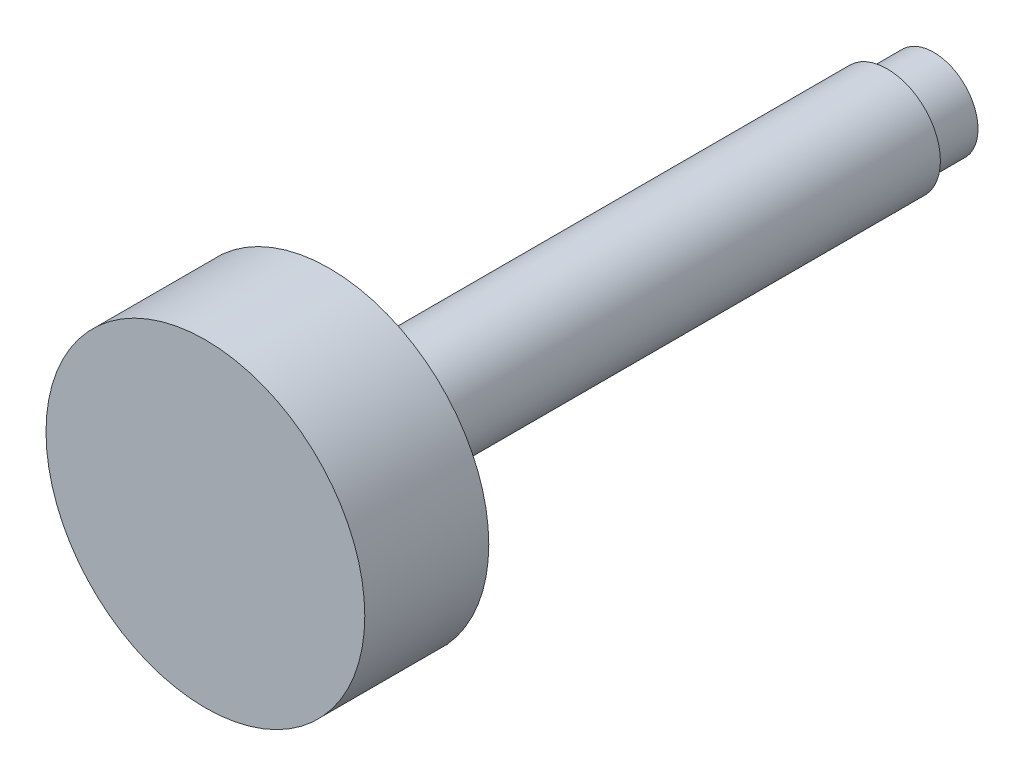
ISO-10303-21;
HEADER;
FILE_DESCRIPTION(('STEP AP214'),'2;1');
FILE_NAME('part.step','',(''),(''),'','','');
FILE_SCHEMA(('AUTOMOTIVE_DESIGN { 1 0 10303 214 1 1 1 1 }'));
ENDSEC;
DATA;
#1=APPLICATION_CONTEXT('core data for automotive mechanical design processes');
#2=APPLICATION_PROTOCOL_DEFINITION('international standard','automotive_design',2000,#1);
#3=PRODUCT_CONTEXT('',#1,'mechanical');
#4=PRODUCT('Part','Part','',(#3));
#5=PRODUCT_RELATED_PRODUCT_CATEGORY('part','',(#4));
#6=PRODUCT_DEFINITION_FORMATION('','',#4);
#7=PRODUCT_DEFINITION_CONTEXT('part definition',#1,'design');
#8=PRODUCT_DEFINITION('design','',#6,#7);
#9=PRODUCT_DEFINITION_SHAPE('','',#8);
#10=(LENGTH_UNIT() NAMED_UNIT(*) SI_UNIT(.MILLI.,.METRE.));
#11=(NAMED_UNIT(*) PLANE_ANGLE_UNIT() SI_UNIT($,.RADIAN.));
#12=(NAMED_UNIT(*) SI_UNIT($,.STERADIAN.) SOLID_ANGLE_UNIT());
#13=UNCERTAINTY_MEASURE_WITH_UNIT(LENGTH_MEASURE(1.E-05),#10,'distance_accuracy_value','');
#14=(GEOMETRIC_REPRESENTATION_CONTEXT(3) GLOBAL_UNCERTAINTY_ASSIGNED_CONTEXT((#13)) GLOBAL_UNIT_ASSIGNED_CONTEXT((#10,
#11,#12)) REPRESENTATION_CONTEXT('',''));
#15=CARTESIAN_POINT('',(0.,0.,0.));
#16=DIRECTION('',(0.,0.,1.));
#17=DIRECTION('',(1.,0.,0.));
#18=AXIS2_PLACEMENT_3D('',#15,#16,#17);
#19=CARTESIAN_POINT('',(0.,0.,4.));
#20=DIRECTION('',(0.,0.,1.));
#21=DIRECTION('',(1.,0.,0.));
#22=AXIS2_PLACEMENT_3D('',#19,#20,#21);
#23=SPHERICAL_SURFACE('',#22,4.);
#24=CARTESIAN_POINT('',(0.,0.,0.8775010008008));
#25=DIRECTION('',(0.,0.,1.));
#26=DIRECTION('',(1.,0.,0.));
#27=AXIS2_PLACEMENT_3D('',#24,#25,#26);
#28=CIRCLE('',#27,2.5);
#29=CARTESIAN_POINT('',(2.5,0.,0.8775010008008));
#30=VERTEX_POINT('',#29);
#31=EDGE_CURVE('E8',#30,#30,#28,.T.);
#32=ORIENTED_EDGE('',*,*,#31,.F.);
#33=EDGE_LOOP('',(#32));
#34=FACE_BOUND('',#33,.T.);
#35=ADVANCED_FACE('F12',(#34),#23,.T.);
#36=CARTESIAN_POINT('',(0.,0.,40.017563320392));
#37=DIRECTION('',(0.,0.,1.));
#38=DIRECTION('',(1.,0.,0.));
#39=AXIS2_PLACEMENT_3D('',#36,#37,#38);
#40=CYLINDRICAL_SURFACE('',#39,2.5);
#41=CARTESIAN_POINT('',(0.,0.,3.5));
#42=DIRECTION('',(0.,0.,1.));
#43=DIRECTION('',(1.,0.,0.));
#44=AXIS2_PLACEMENT_3D('',#41,#42,#43);
#45=CIRCLE('',#44,2.5);
#46=CARTESIAN_POINT('',(2.5,0.,3.5));
#47=VERTEX_POINT('',#46);
#48=EDGE_CURVE('E18',#47,#47,#45,.T.);
#49=ORIENTED_EDGE('',*,*,#48,.F.);
#50=EDGE_LOOP('',(#49));
#51=FACE_BOUND('',#50,.T.);
#52=ORIENTED_EDGE('',*,*,#31,.T.);
#53=EDGE_LOOP('',(#52));
#54=FACE_BOUND('',#53,.T.);
#55=ADVANCED_FACE('F60',(#51,#54),#40,.T.);
#56=CARTESIAN_POINT('',(-2.5,0.,3.5));
#57=DIRECTION('',(0.,0.,1.));
#58=DIRECTION('',(1.,0.,0.));
#59=AXIS2_PLACEMENT_3D('',#56,#57,#58);
#60=PLANE('',#59);
#61=CARTESIAN_POINT('',(0.,0.,3.5));
#62=DIRECTION('',(0.,0.,1.));
#63=DIRECTION('',(1.,0.,0.));
#64=AXIS2_PLACEMENT_3D('',#61,#62,#63);
#65=CIRCLE('',#64,3.);
#66=CARTESIAN_POINT('',(3.,0.,3.5));
#67=VERTEX_POINT('',#66);
#68=EDGE_CURVE('E22',#67,#67,#65,.T.);
#69=ORIENTED_EDGE('',*,*,#68,.F.);
#70=EDGE_LOOP('',(#69));
#71=FACE_BOUND('',#70,.T.);
#72=ORIENTED_EDGE('',*,*,#48,.T.);
#73=EDGE_LOOP('',(#72));
#74=FACE_BOUND('',#73,.T.);
#75=ADVANCED_FACE('F55',(#71,#74),#60,.F.);
#76=CARTESIAN_POINT('',(0.,0.,40.017563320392));
#77=DIRECTION('',(0.,0.,1.));
#78=DIRECTION('',(1.,0.,0.));
#79=AXIS2_PLACEMENT_3D('',#76,#77,#78);
#80=CYLINDRICAL_SURFACE('',#79,3.);
#81=CARTESIAN_POINT('',(0.,0.,35.));
#82=DIRECTION('',(0.,0.,1.));
#83=DIRECTION('',(1.,0.,0.));
#84=AXIS2_PLACEMENT_3D('',#81,#82,#83);
#85=CIRCLE('',#84,3.);
#86=CARTESIAN_POINT('',(3.,0.,35.));
#87=VERTEX_POINT('',#86);
#88=EDGE_CURVE('E26',#87,#87,#85,.T.);
#89=ORIENTED_EDGE('',*,*,#88,.F.);
#90=EDGE_LOOP('',(#89));
#91=FACE_BOUND('',#90,.T.);
#92=ORIENTED_EDGE('',*,*,#68,.T.);
#93=EDGE_LOOP('',(#92));
#94=FACE_BOUND('',#93,.T.);
#95=ADVANCED_FACE('F49',(#91,#94),#80,.T.);
#96=CARTESIAN_POINT('',(-3.,0.,35.));
#97=DIRECTION('',(0.,0.,1.));
#98=DIRECTION('',(1.,0.,0.));
#99=AXIS2_PLACEMENT_3D('',#96,#97,#98);
#100=PLANE('',#99);
#101=CARTESIAN_POINT('',(0.,0.,35.));
#102=DIRECTION('',(0.,0.,1.));
#103=DIRECTION('',(1.,0.,0.));
#104=AXIS2_PLACEMENT_3D('',#101,#102,#103);
#105=CIRCLE('',#104,9.);
#106=CARTESIAN_POINT('',(9.,0.,35.));
#107=VERTEX_POINT('',#106);
#108=EDGE_CURVE('E31',#107,#107,#105,.T.);
#109=ORIENTED_EDGE('',*,*,#108,.F.);
#110=EDGE_LOOP('',(#109));
#111=FACE_BOUND('',#110,.T.);
#112=ORIENTED_EDGE('',*,*,#88,.T.);
#113=EDGE_LOOP('',(#112));
#114=FACE_BOUND('',#113,.T.);
#115=ADVANCED_FACE('F43',(#111,#114),#100,.F.);
#116=CARTESIAN_POINT('',(0.,0.,40.017563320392));
#117=DIRECTION('',(0.,0.,1.));
#118=DIRECTION('',(1.,0.,0.));
#119=AXIS2_PLACEMENT_3D('',#116,#117,#118);
#120=CYLINDRICAL_SURFACE('',#119,9.);
#121=CARTESIAN_POINT('',(0.,0.,42.));
#122=DIRECTION('',(0.,0.,1.));
#123=DIRECTION('',(1.,0.,0.));
#124=AXIS2_PLACEMENT_3D('',#121,#122,#123);
#125=CIRCLE('',#124,9.);
#126=CARTESIAN_POINT('',(9.,0.,42.));
#127=VERTEX_POINT('',#126);
#128=EDGE_CURVE('E34',#127,#127,#125,.T.);
#129=ORIENTED_EDGE('',*,*,#128,.F.);
#130=EDGE_LOOP('',(#129));
#131=FACE_BOUND('',#130,.T.);
#132=ORIENTED_EDGE('',*,*,#108,.T.);
#133=EDGE_LOOP('',(#132));
#134=FACE_BOUND('',#133,.T.);
#135=ADVANCED_FACE('F40',(#131,#134),#120,.T.);
#136=CARTESIAN_POINT('',(-9.,0.,42.));
#137=DIRECTION('',(0.,0.,-1.));
#138=DIRECTION('',(-1.,0.,0.));
#139=AXIS2_PLACEMENT_3D('',#136,#137,#138);
#140=PLANE('',#139);
#141=ORIENTED_EDGE('',*,*,#128,.T.);
#142=EDGE_LOOP('',(#141));
#143=FACE_BOUND('',#142,.T.);
#144=ADVANCED_FACE('F38',(#143),#140,.F.);
#145=CLOSED_SHELL('',(#35,#55,#75,#95,#115,#135,#144));
#146=MANIFOLD_SOLID_BREP('B1',#145);
#147=ADVANCED_BREP_SHAPE_REPRESENTATION('',(#18,#146),#14);
#148=SHAPE_DEFINITION_REPRESENTATION(#9,#147);
ENDSEC;
END-ISO-10303-21;
